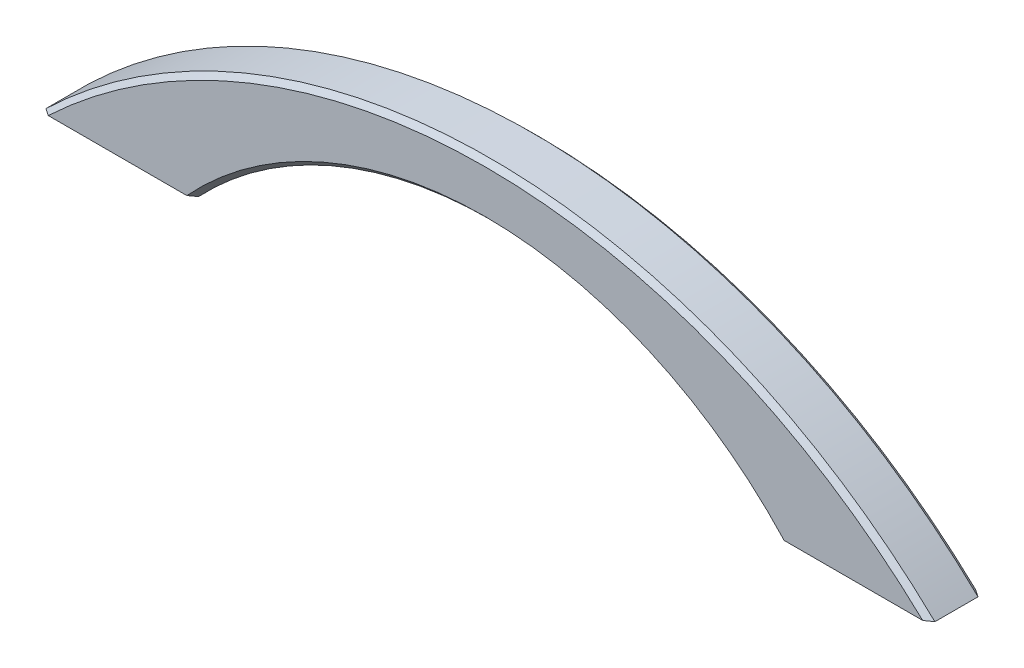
ISO-10303-21;
HEADER;
FILE_DESCRIPTION(('STEP AP214'),'2;1');
FILE_NAME('part.step','',(''),(''),'','','');
FILE_SCHEMA(('AUTOMOTIVE_DESIGN { 1 0 10303 214 1 1 1 1 }'));
ENDSEC;
DATA;
#1=APPLICATION_CONTEXT('core data for automotive mechanical design processes');
#2=APPLICATION_PROTOCOL_DEFINITION('international standard','automotive_design',2000,#1);
#3=PRODUCT_CONTEXT('',#1,'mechanical');
#4=PRODUCT('Part','Part','',(#3));
#5=PRODUCT_RELATED_PRODUCT_CATEGORY('part','',(#4));
#6=PRODUCT_DEFINITION_FORMATION('','',#4);
#7=PRODUCT_DEFINITION_CONTEXT('part definition',#1,'design');
#8=PRODUCT_DEFINITION('design','',#6,#7);
#9=PRODUCT_DEFINITION_SHAPE('','',#8);
#10=(LENGTH_UNIT() NAMED_UNIT(*) SI_UNIT(.MILLI.,.METRE.));
#11=(NAMED_UNIT(*) PLANE_ANGLE_UNIT() SI_UNIT($,.RADIAN.));
#12=(NAMED_UNIT(*) SI_UNIT($,.STERADIAN.) SOLID_ANGLE_UNIT());
#13=UNCERTAINTY_MEASURE_WITH_UNIT(LENGTH_MEASURE(1.E-05),#10,'distance_accuracy_value','');
#14=(GEOMETRIC_REPRESENTATION_CONTEXT(3) GLOBAL_UNCERTAINTY_ASSIGNED_CONTEXT((#13)) GLOBAL_UNIT_ASSIGNED_CONTEXT((#10,
#11,#12)) REPRESENTATION_CONTEXT('',''));
#15=CARTESIAN_POINT('',(0.,0.,0.));
#16=DIRECTION('',(0.,0.,1.));
#17=DIRECTION('',(1.,0.,0.));
#18=AXIS2_PLACEMENT_3D('',#15,#16,#17);
#19=CARTESIAN_POINT('',(0.,-41.4473684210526,4.));
#20=DIRECTION('',(0.,0.,-1.));
#21=DIRECTION('',(-1.,0.,0.));
#22=AXIS2_PLACEMENT_3D('',#19,#20,#21);
#23=CYLINDRICAL_SURFACE('',#22,60.4473684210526);
#24=DIRECTION('',(0.,0.,-1.));
#25=VECTOR('',#24,1.);
#26=CARTESIAN_POINT('',(-44.,0.,4.));
#27=LINE('',#26,#25);
#28=CARTESIAN_POINT('',(-44.,0.,3.25000000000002));
#29=VERTEX_POINT('',#28);
#30=CARTESIAN_POINT('',(-44.,0.,-3.24999999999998));
#31=VERTEX_POINT('',#30);
#32=EDGE_CURVE('E151',#29,#31,#27,.T.);
#33=ORIENTED_EDGE('',*,*,#32,.T.);
#34=CARTESIAN_POINT('',(0.,-41.4473684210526,-3.24999999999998));
#35=DIRECTION('',(0.,0.,-1.));
#36=DIRECTION('',(-1.,0.,0.));
#37=AXIS2_PLACEMENT_3D('',#34,#35,#36);
#38=CIRCLE('',#37,60.4473684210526);
#39=CARTESIAN_POINT('',(44.,0.,-3.24999999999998));
#40=VERTEX_POINT('',#39);
#41=EDGE_CURVE('E175',#31,#40,#38,.T.);
#42=ORIENTED_EDGE('',*,*,#41,.T.);
#43=DIRECTION('',(0.,0.,-1.));
#44=VECTOR('',#43,1.);
#45=CARTESIAN_POINT('',(44.,0.,4.));
#46=LINE('',#45,#44);
#47=CARTESIAN_POINT('',(44.,0.,3.25000000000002));
#48=VERTEX_POINT('',#47);
#49=EDGE_CURVE('E168',#48,#40,#46,.T.);
#50=ORIENTED_EDGE('',*,*,#49,.F.);
#51=CARTESIAN_POINT('',(0.,-41.4473684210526,3.25000000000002));
#52=DIRECTION('',(0.,0.,-1.));
#53=DIRECTION('',(-1.,0.,0.));
#54=AXIS2_PLACEMENT_3D('',#51,#52,#53);
#55=CIRCLE('',#54,60.4473684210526);
#56=EDGE_CURVE('E172',#48,#29,#55,.F.);
#57=ORIENTED_EDGE('',*,*,#56,.T.);
#58=EDGE_LOOP('',(#33,#42,#50,#57));
#59=FACE_BOUND('',#58,.T.);
#60=ADVANCED_FACE('F43',(#59),#23,.F.);
#61=CARTESIAN_POINT('',(67.,0.,4.));
#62=DIRECTION('',(0.,1.,0.));
#63=DIRECTION('',(-1.,0.,0.));
#64=AXIS2_PLACEMENT_3D('',#61,#62,#63);
#65=PLANE('',#64);
#66=CARTESIAN_POINT('',(50.,0.,0.));
#67=DIRECTION('',(0.,-1.,0.));
#68=DIRECTION('',(0.,0.,-1.));
#69=AXIS2_PLACEMENT_3D('',#66,#67,#68);
#70=CIRCLE('',#69,1.64999999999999);
#71=CARTESIAN_POINT('',(50.,0.,-1.64999999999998));
#72=VERTEX_POINT('',#71);
#73=EDGE_CURVE('E127',#72,#72,#70,.T.);
#74=ORIENTED_EDGE('',*,*,#73,.F.);
#75=EDGE_LOOP('',(#74));
#76=FACE_BOUND('',#75,.T.);
#77=ORIENTED_EDGE('',*,*,#49,.T.);
#78=CARTESIAN_POINT('',(44.,0.,-3.24999999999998));
#79=CARTESIAN_POINT('',(44.1711202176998,0.,-3.37456482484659));
#80=CARTESIAN_POINT('',(44.3420811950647,0.,-3.49934723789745));
#81=CARTESIAN_POINT('',(44.6836846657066,0.,-3.74934723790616));
#82=CARTESIAN_POINT('',(44.85432715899,0.,-3.87456482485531));
#83=CARTESIAN_POINT('',(45.0248104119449,0.,-4.));
#84=B_SPLINE_CURVE_WITH_KNOTS('',3,(#78,#79,#80,#81,#82,#83),.UNSPECIFIED.,.F.,.F.,(4,2,4),(0.,
0.63496831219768,1.26993661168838),.UNSPECIFIED.);
#85=CARTESIAN_POINT('',(45.0248104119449,0.,-4.));
#86=VERTEX_POINT('',#85);
#87=EDGE_CURVE('E213',#40,#86,#84,.T.);
#88=ORIENTED_EDGE('',*,*,#87,.T.);
#89=DIRECTION('',(1.,0.,0.));
#90=VECTOR('',#89,1.);
#91=CARTESIAN_POINT('',(67.,0.,-4.));
#92=LINE('',#91,#90);
#93=CARTESIAN_POINT('',(65.9137167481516,0.,-4.));
#94=VERTEX_POINT('',#93);
#95=EDGE_CURVE('E141',#86,#94,#92,.T.);
#96=ORIENTED_EDGE('',*,*,#95,.T.);
#97=CARTESIAN_POINT('',(65.9137167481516,0.,-4.));
#98=CARTESIAN_POINT('',(66.0950139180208,0.,-3.87536203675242));
#99=CARTESIAN_POINT('',(66.2761861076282,0.,-3.75054305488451));
#100=CARTESIAN_POINT('',(66.6382805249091,0.,-3.50054305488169));
#101=CARTESIAN_POINT('',(66.8192027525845,0.,-3.3753620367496));
#102=CARTESIAN_POINT('',(67.,0.,-3.25));
#103=B_SPLINE_CURVE_WITH_KNOTS('',3,(#97,#98,#99,#100,#101,#102),.UNSPECIFIED.,.F.,.F.,(4,2,4),
(0.,0.660021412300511,1.32004281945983),.UNSPECIFIED.);
#104=CARTESIAN_POINT('',(67.,0.,-3.25));
#105=VERTEX_POINT('',#104);
#106=EDGE_CURVE('E187',#94,#105,#103,.T.);
#107=ORIENTED_EDGE('',*,*,#106,.T.);
#108=DIRECTION('',(0.,0.,-1.));
#109=VECTOR('',#108,1.);
#110=CARTESIAN_POINT('',(67.,0.,4.));
#111=LINE('',#110,#109);
#112=CARTESIAN_POINT('',(67.,0.,3.24999999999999));
#113=VERTEX_POINT('',#112);
#114=EDGE_CURVE('E164',#113,#105,#111,.T.);
#115=ORIENTED_EDGE('',*,*,#114,.F.);
#116=CARTESIAN_POINT('',(67.,0.,3.24999999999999));
#117=CARTESIAN_POINT('',(66.8192027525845,0.,3.37536203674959));
#118=CARTESIAN_POINT('',(66.6382805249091,0.,3.50054305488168));
#119=CARTESIAN_POINT('',(66.2761861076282,0.,3.75054305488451));
#120=CARTESIAN_POINT('',(66.0950139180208,0.,3.87536203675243));
#121=CARTESIAN_POINT('',(65.9137167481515,0.,4.00000000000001));
#122=B_SPLINE_CURVE_WITH_KNOTS('',3,(#116,#117,#118,#119,#120,#121),.UNSPECIFIED.,.F.,.F.,(4,2,
4),(0.,0.660021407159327,1.32004281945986),.UNSPECIFIED.);
#123=CARTESIAN_POINT('',(65.9137167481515,0.,4.));
#124=VERTEX_POINT('',#123);
#125=EDGE_CURVE('E179',#113,#124,#122,.T.);
#126=ORIENTED_EDGE('',*,*,#125,.T.);
#127=DIRECTION('',(1.,0.,0.));
#128=VECTOR('',#127,1.);
#129=CARTESIAN_POINT('',(67.,0.,4.));
#130=LINE('',#129,#128);
#131=CARTESIAN_POINT('',(45.0248104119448,0.,4.));
#132=VERTEX_POINT('',#131);
#133=EDGE_CURVE('E142',#132,#124,#130,.T.);
#134=ORIENTED_EDGE('',*,*,#133,.F.);
#135=CARTESIAN_POINT('',(45.0248104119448,0.,4.));
#136=CARTESIAN_POINT('',(44.85432715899,0.,3.87456482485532));
#137=CARTESIAN_POINT('',(44.6836846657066,0.,3.74934723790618));
#138=CARTESIAN_POINT('',(44.3420811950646,0.,3.49934723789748));
#139=CARTESIAN_POINT('',(44.1711202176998,0.,3.37456482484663));
#140=CARTESIAN_POINT('',(44.,0.,3.25000000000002));
#141=B_SPLINE_CURVE_WITH_KNOTS('',3,(#135,#136,#137,#138,#139,#140),.UNSPECIFIED.,.F.,.F.,(4,2,
4),(0.,0.634968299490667,1.26993661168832),.UNSPECIFIED.);
#142=EDGE_CURVE('E206',#132,#48,#141,.T.);
#143=ORIENTED_EDGE('',*,*,#142,.T.);
#144=EDGE_LOOP('',(#77,#88,#96,#107,#115,#126,#134,#143));
#145=FACE_BOUND('',#144,.T.);
#146=ADVANCED_FACE('F193',(#76,#145),#65,.F.);
#147=CARTESIAN_POINT('',(0.,-69.6296296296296,4.));
#148=DIRECTION('',(0.,0.,-1.));
#149=DIRECTION('',(-1.,0.,0.));
#150=AXIS2_PLACEMENT_3D('',#147,#148,#149);
#151=CYLINDRICAL_SURFACE('',#150,96.6296296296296);
#152=ORIENTED_EDGE('',*,*,#114,.T.);
#153=CARTESIAN_POINT('',(0.,-69.6296296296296,-3.25));
#154=DIRECTION('',(0.,0.,-1.));
#155=DIRECTION('',(-1.,0.,0.));
#156=AXIS2_PLACEMENT_3D('',#153,#154,#155);
#157=CIRCLE('',#156,96.6296296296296);
#158=CARTESIAN_POINT('',(-67.,0.,-3.25));
#159=VERTEX_POINT('',#158);
#160=EDGE_CURVE('E11',#105,#159,#157,.F.);
#161=ORIENTED_EDGE('',*,*,#160,.T.);
#162=DIRECTION('',(0.,0.,-1.));
#163=VECTOR('',#162,1.);
#164=CARTESIAN_POINT('',(-67.,0.,4.));
#165=LINE('',#164,#163);
#166=CARTESIAN_POINT('',(-67.,0.,3.24999999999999));
#167=VERTEX_POINT('',#166);
#168=EDGE_CURVE('E161',#167,#159,#165,.T.);
#169=ORIENTED_EDGE('',*,*,#168,.F.);
#170=CARTESIAN_POINT('',(0.,-69.6296296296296,3.24999999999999));
#171=DIRECTION('',(0.,0.,-1.));
#172=DIRECTION('',(-1.,0.,0.));
#173=AXIS2_PLACEMENT_3D('',#170,#171,#172);
#174=CIRCLE('',#173,96.6296296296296);
#175=EDGE_CURVE('E54',#167,#113,#174,.T.);
#176=ORIENTED_EDGE('',*,*,#175,.T.);
#177=EDGE_LOOP('',(#152,#161,#169,#176));
#178=FACE_BOUND('',#177,.T.);
#179=ADVANCED_FACE('F198',(#178),#151,.T.);
#180=CARTESIAN_POINT('',(-44.,0.,4.));
#181=DIRECTION('',(0.,1.,0.));
#182=DIRECTION('',(-1.,0.,0.));
#183=AXIS2_PLACEMENT_3D('',#180,#181,#182);
#184=PLANE('',#183);
#185=CARTESIAN_POINT('',(-50.,0.,0.));
#186=DIRECTION('',(0.,-1.,0.));
#187=DIRECTION('',(0.,0.,-1.));
#188=AXIS2_PLACEMENT_3D('',#185,#186,#187);
#189=CIRCLE('',#188,1.64999999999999);
#190=CARTESIAN_POINT('',(-50.,0.,-1.64999999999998));
#191=VERTEX_POINT('',#190);
#192=EDGE_CURVE('E128',#191,#191,#189,.T.);
#193=ORIENTED_EDGE('',*,*,#192,.F.);
#194=EDGE_LOOP('',(#193));
#195=FACE_BOUND('',#194,.T.);
#196=DIRECTION('',(1.,0.,0.));
#197=VECTOR('',#196,1.);
#198=CARTESIAN_POINT('',(-44.,0.,-4.));
#199=LINE('',#198,#197);
#200=CARTESIAN_POINT('',(-65.9137167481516,0.,-4.));
#201=VERTEX_POINT('',#200);
#202=CARTESIAN_POINT('',(-45.0248104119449,0.,-4.));
#203=VERTEX_POINT('',#202);
#204=EDGE_CURVE('E147',#201,#203,#199,.T.);
#205=ORIENTED_EDGE('',*,*,#204,.T.);
#206=CARTESIAN_POINT('',(-45.0248104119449,0.,-4.));
#207=CARTESIAN_POINT('',(-44.85432715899,0.,-3.87456482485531));
#208=CARTESIAN_POINT('',(-44.6836846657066,0.,-3.74934723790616));
#209=CARTESIAN_POINT('',(-44.3420811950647,0.,-3.49934723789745));
#210=CARTESIAN_POINT('',(-44.1711202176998,0.,-3.37456482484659));
#211=CARTESIAN_POINT('',(-44.,0.,-3.24999999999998));
#212=B_SPLINE_CURVE_WITH_KNOTS('',3,(#206,#207,#208,#209,#210,#211),.UNSPECIFIED.,.F.,.F.,(4,2,
4),(0.,0.634968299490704,1.26993661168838),.UNSPECIFIED.);
#213=EDGE_CURVE('E242',#203,#31,#212,.T.);
#214=ORIENTED_EDGE('',*,*,#213,.T.);
#215=ORIENTED_EDGE('',*,*,#32,.F.);
#216=CARTESIAN_POINT('',(-44.,0.,3.25000000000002));
#217=CARTESIAN_POINT('',(-44.1711202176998,0.,3.37456482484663));
#218=CARTESIAN_POINT('',(-44.3420811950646,0.,3.49934723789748));
#219=CARTESIAN_POINT('',(-44.6836846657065,0.,3.74934723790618));
#220=CARTESIAN_POINT('',(-44.8543271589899,0.,3.87456482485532));
#221=CARTESIAN_POINT('',(-45.0248104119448,0.,4.));
#222=B_SPLINE_CURVE_WITH_KNOTS('',3,(#216,#217,#218,#219,#220,#221),.UNSPECIFIED.,.F.,.F.,(4,2,
4),(0.,0.634968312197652,1.26993661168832),.UNSPECIFIED.);
#223=CARTESIAN_POINT('',(-45.0248104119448,0.,4.));
#224=VERTEX_POINT('',#223);
#225=EDGE_CURVE('E234',#29,#224,#222,.T.);
#226=ORIENTED_EDGE('',*,*,#225,.T.);
#227=DIRECTION('',(1.,0.,0.));
#228=VECTOR('',#227,1.);
#229=CARTESIAN_POINT('',(-44.,0.,4.));
#230=LINE('',#229,#228);
#231=CARTESIAN_POINT('',(-65.9137167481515,0.,4.));
#232=VERTEX_POINT('',#231);
#233=EDGE_CURVE('E146',#232,#224,#230,.T.);
#234=ORIENTED_EDGE('',*,*,#233,.F.);
#235=CARTESIAN_POINT('',(-65.9137167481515,0.,4.));
#236=CARTESIAN_POINT('',(-66.0950139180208,0.,3.87536203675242));
#237=CARTESIAN_POINT('',(-66.2761861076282,0.,3.75054305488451));
#238=CARTESIAN_POINT('',(-66.6382805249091,0.,3.50054305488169));
#239=CARTESIAN_POINT('',(-66.8192027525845,0.,3.37536203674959));
#240=CARTESIAN_POINT('',(-67.,0.,3.24999999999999));
#241=B_SPLINE_CURVE_WITH_KNOTS('',3,(#235,#236,#237,#238,#239,#240),.UNSPECIFIED.,.F.,.F.,(4,2,
4),(0.,0.660021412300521,1.32004281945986),.UNSPECIFIED.);
#242=EDGE_CURVE('E68',#232,#167,#241,.T.);
#243=ORIENTED_EDGE('',*,*,#242,.T.);
#244=ORIENTED_EDGE('',*,*,#168,.T.);
#245=CARTESIAN_POINT('',(-67.,0.,-3.25));
#246=CARTESIAN_POINT('',(-66.8192027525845,0.,-3.3753620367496));
#247=CARTESIAN_POINT('',(-66.6382805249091,0.,-3.50054305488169));
#248=CARTESIAN_POINT('',(-66.2761861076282,0.,-3.75054305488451));
#249=CARTESIAN_POINT('',(-66.0950139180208,0.,-3.87536203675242));
#250=CARTESIAN_POINT('',(-65.9137167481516,0.,-3.99999999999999));
#251=B_SPLINE_CURVE_WITH_KNOTS('',3,(#245,#246,#247,#248,#249,#250),.UNSPECIFIED.,.F.,.F.,(4,2,
4),(0.,0.660021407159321,1.32004281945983),.UNSPECIFIED.);
#252=EDGE_CURVE('E61',#159,#201,#251,.T.);
#253=ORIENTED_EDGE('',*,*,#252,.T.);
#254=EDGE_LOOP('',(#205,#214,#215,#226,#234,#243,#244,#253));
#255=FACE_BOUND('',#254,.T.);
#256=ADVANCED_FACE('F253',(#195,#255),#184,.F.);
#257=CARTESIAN_POINT('',(0.,-41.4473684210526,4.));
#258=DIRECTION('',(0.,0.,-1.));
#259=DIRECTION('',(-1.,0.,0.));
#260=AXIS2_PLACEMENT_3D('',#257,#258,#259);
#261=PLANE('',#260);
#262=ORIENTED_EDGE('',*,*,#233,.T.);
#263=CARTESIAN_POINT('',(0.,-41.4473684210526,4.));
#264=DIRECTION('',(0.,0.,-1.));
#265=DIRECTION('',(-1.,0.,0.));
#266=AXIS2_PLACEMENT_3D('',#263,#264,#265);
#267=CIRCLE('',#266,61.1973684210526);
#268=EDGE_CURVE('E290',#224,#132,#267,.T.);
#269=ORIENTED_EDGE('',*,*,#268,.T.);
#270=ORIENTED_EDGE('',*,*,#133,.T.);
#271=CARTESIAN_POINT('',(0.,-69.6296296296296,4.));
#272=DIRECTION('',(0.,0.,-1.));
#273=DIRECTION('',(-1.,0.,0.));
#274=AXIS2_PLACEMENT_3D('',#271,#272,#273);
#275=CIRCLE('',#274,95.8796296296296);
#276=EDGE_CURVE('E287',#124,#232,#275,.F.);
#277=ORIENTED_EDGE('',*,*,#276,.T.);
#278=EDGE_LOOP('',(#262,#269,#270,#277));
#279=FACE_BOUND('',#278,.T.);
#280=ADVANCED_FACE('F257',(#279),#261,.F.);
#281=CARTESIAN_POINT('',(0.,-41.4473684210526,-4.));
#282=DIRECTION('',(0.,0.,-1.));
#283=DIRECTION('',(-1.,0.,0.));
#284=AXIS2_PLACEMENT_3D('',#281,#282,#283);
#285=PLANE('',#284);
#286=ORIENTED_EDGE('',*,*,#95,.F.);
#287=CARTESIAN_POINT('',(0.,-41.4473684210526,-4.));
#288=DIRECTION('',(0.,0.,-1.));
#289=DIRECTION('',(-1.,0.,0.));
#290=AXIS2_PLACEMENT_3D('',#287,#288,#289);
#291=CIRCLE('',#290,61.1973684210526);
#292=EDGE_CURVE('E270',#86,#203,#291,.F.);
#293=ORIENTED_EDGE('',*,*,#292,.T.);
#294=ORIENTED_EDGE('',*,*,#204,.F.);
#295=CARTESIAN_POINT('',(0.,-69.6296296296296,-4.));
#296=DIRECTION('',(0.,0.,-1.));
#297=DIRECTION('',(-1.,0.,0.));
#298=AXIS2_PLACEMENT_3D('',#295,#296,#297);
#299=CIRCLE('',#298,95.8796296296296);
#300=EDGE_CURVE('E272',#201,#94,#299,.T.);
#301=ORIENTED_EDGE('',*,*,#300,.T.);
#302=EDGE_LOOP('',(#286,#293,#294,#301));
#303=FACE_BOUND('',#302,.T.);
#304=ADVANCED_FACE('F259',(#303),#285,.T.);
#305=CARTESIAN_POINT('',(50.,6.00000000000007,0.));
#306=DIRECTION('',(0.,-1.,0.));
#307=DIRECTION('',(0.,0.,-1.));
#308=AXIS2_PLACEMENT_3D('',#305,#306,#307);
#309=CONICAL_SURFACE('',#308,1.65,1.02974425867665);
#310=CARTESIAN_POINT('',(50.,6.99142002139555,0.));
#311=VERTEX_POINT('',#310);
#312=VERTEX_LOOP('',#311);
#313=FACE_BOUND('',#312,.T.);
#314=CARTESIAN_POINT('',(50.,6.00000000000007,0.));
#315=DIRECTION('',(0.,-1.,0.));
#316=DIRECTION('',(0.,0.,-1.));
#317=AXIS2_PLACEMENT_3D('',#314,#315,#316);
#318=CIRCLE('',#317,1.65);
#319=CARTESIAN_POINT('',(50.,6.00000000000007,-1.64999999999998));
#320=VERTEX_POINT('',#319);
#321=EDGE_CURVE('E133',#320,#320,#318,.T.);
#322=ORIENTED_EDGE('',*,*,#321,.T.);
#323=EDGE_LOOP('',(#322));
#324=FACE_BOUND('',#323,.T.);
#325=ADVANCED_FACE('F318',(#313,#324),#309,.F.);
#326=CARTESIAN_POINT('',(50.,0.,0.));
#327=DIRECTION('',(0.,-1.,0.));
#328=DIRECTION('',(0.,0.,-1.));
#329=AXIS2_PLACEMENT_3D('',#326,#327,#328);
#330=CYLINDRICAL_SURFACE('',#329,1.65);
#331=ORIENTED_EDGE('',*,*,#321,.F.);
#332=EDGE_LOOP('',(#331));
#333=FACE_BOUND('',#332,.T.);
#334=ORIENTED_EDGE('',*,*,#73,.T.);
#335=EDGE_LOOP('',(#334));
#336=FACE_BOUND('',#335,.T.);
#337=ADVANCED_FACE('F120',(#333,#336),#330,.F.);
#338=CARTESIAN_POINT('',(-50.,5.99999999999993,0.));
#339=DIRECTION('',(0.,-1.,0.));
#340=DIRECTION('',(0.,0.,-1.));
#341=AXIS2_PLACEMENT_3D('',#338,#339,#340);
#342=CONICAL_SURFACE('',#341,1.65,1.02974425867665);
#343=CARTESIAN_POINT('',(-50.,6.9914200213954,0.));
#344=VERTEX_POINT('',#343);
#345=VERTEX_LOOP('',#344);
#346=FACE_BOUND('',#345,.T.);
#347=CARTESIAN_POINT('',(-50.,5.99999999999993,0.));
#348=DIRECTION('',(0.,-1.,0.));
#349=DIRECTION('',(0.,0.,-1.));
#350=AXIS2_PLACEMENT_3D('',#347,#348,#349);
#351=CIRCLE('',#350,1.65);
#352=CARTESIAN_POINT('',(-50.,5.99999999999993,-1.64999999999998));
#353=VERTEX_POINT('',#352);
#354=EDGE_CURVE('E124',#353,#353,#351,.T.);
#355=ORIENTED_EDGE('',*,*,#354,.T.);
#356=EDGE_LOOP('',(#355));
#357=FACE_BOUND('',#356,.T.);
#358=ADVANCED_FACE('F116',(#346,#357),#342,.F.);
#359=CARTESIAN_POINT('',(-50.,0.,0.));
#360=DIRECTION('',(0.,-1.,0.));
#361=DIRECTION('',(0.,0.,-1.));
#362=AXIS2_PLACEMENT_3D('',#359,#360,#361);
#363=CYLINDRICAL_SURFACE('',#362,1.65);
#364=ORIENTED_EDGE('',*,*,#354,.F.);
#365=EDGE_LOOP('',(#364));
#366=FACE_BOUND('',#365,.T.);
#367=ORIENTED_EDGE('',*,*,#192,.T.);
#368=EDGE_LOOP('',(#367));
#369=FACE_BOUND('',#368,.T.);
#370=ADVANCED_FACE('F119',(#366,#369),#363,.F.);
#371=CARTESIAN_POINT('',(0.,-41.4473684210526,-3.24999999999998));
#372=DIRECTION('',(0.,0.,-1.));
#373=DIRECTION('',(-1.,0.,0.));
#374=AXIS2_PLACEMENT_3D('',#371,#372,#373);
#375=CONICAL_SURFACE('',#374,60.4473684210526,0.785398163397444);
#376=ORIENTED_EDGE('',*,*,#213,.F.);
#377=ORIENTED_EDGE('',*,*,#292,.F.);
#378=ORIENTED_EDGE('',*,*,#87,.F.);
#379=ORIENTED_EDGE('',*,*,#41,.F.);
#380=EDGE_LOOP('',(#376,#377,#378,#379));
#381=FACE_BOUND('',#380,.T.);
#382=ADVANCED_FACE('F228',(#381),#375,.F.);
#383=CARTESIAN_POINT('',(0.,-41.4473684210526,4.));
#384=DIRECTION('',(0.,0.,1.));
#385=DIRECTION('',(1.,0.,0.));
#386=AXIS2_PLACEMENT_3D('',#383,#384,#385);
#387=CONICAL_SURFACE('',#386,61.1973684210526,0.785398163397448);
#388=ORIENTED_EDGE('',*,*,#225,.F.);
#389=ORIENTED_EDGE('',*,*,#56,.F.);
#390=ORIENTED_EDGE('',*,*,#142,.F.);
#391=ORIENTED_EDGE('',*,*,#268,.F.);
#392=EDGE_LOOP('',(#388,#389,#390,#391));
#393=FACE_BOUND('',#392,.T.);
#394=ADVANCED_FACE('F220',(#393),#387,.F.);
#395=CARTESIAN_POINT('',(0.,-69.6296296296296,-3.25));
#396=DIRECTION('',(0.,0.,1.));
#397=DIRECTION('',(1.,0.,0.));
#398=AXIS2_PLACEMENT_3D('',#395,#396,#397);
#399=CONICAL_SURFACE('',#398,96.6296296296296,0.785398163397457);
#400=ORIENTED_EDGE('',*,*,#106,.F.);
#401=ORIENTED_EDGE('',*,*,#300,.F.);
#402=ORIENTED_EDGE('',*,*,#252,.F.);
#403=ORIENTED_EDGE('',*,*,#160,.F.);
#404=EDGE_LOOP('',(#400,#401,#402,#403));
#405=FACE_BOUND('',#404,.T.);
#406=ADVANCED_FACE('F227',(#405),#399,.T.);
#407=CARTESIAN_POINT('',(0.,-69.6296296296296,4.));
#408=DIRECTION('',(0.,0.,-1.));
#409=DIRECTION('',(-1.,0.,0.));
#410=AXIS2_PLACEMENT_3D('',#407,#408,#409);
#411=CONICAL_SURFACE('',#410,95.8796296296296,0.785398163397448);
#412=ORIENTED_EDGE('',*,*,#125,.F.);
#413=ORIENTED_EDGE('',*,*,#175,.F.);
#414=ORIENTED_EDGE('',*,*,#242,.F.);
#415=ORIENTED_EDGE('',*,*,#276,.F.);
#416=EDGE_LOOP('',(#412,#413,#414,#415));
#417=FACE_BOUND('',#416,.T.);
#418=ADVANCED_FACE('F46',(#417),#411,.T.);
#419=CLOSED_SHELL('',(#60,#146,#179,#256,#280,#304,#325,#337,#358,#370,#382,#394,#406,#418));
#420=MANIFOLD_SOLID_BREP('B2',#419);
#421=ADVANCED_BREP_SHAPE_REPRESENTATION('',(#18,#420),#14);
#422=SHAPE_DEFINITION_REPRESENTATION(#9,#421);
ENDSEC;
END-ISO-10303-21;
